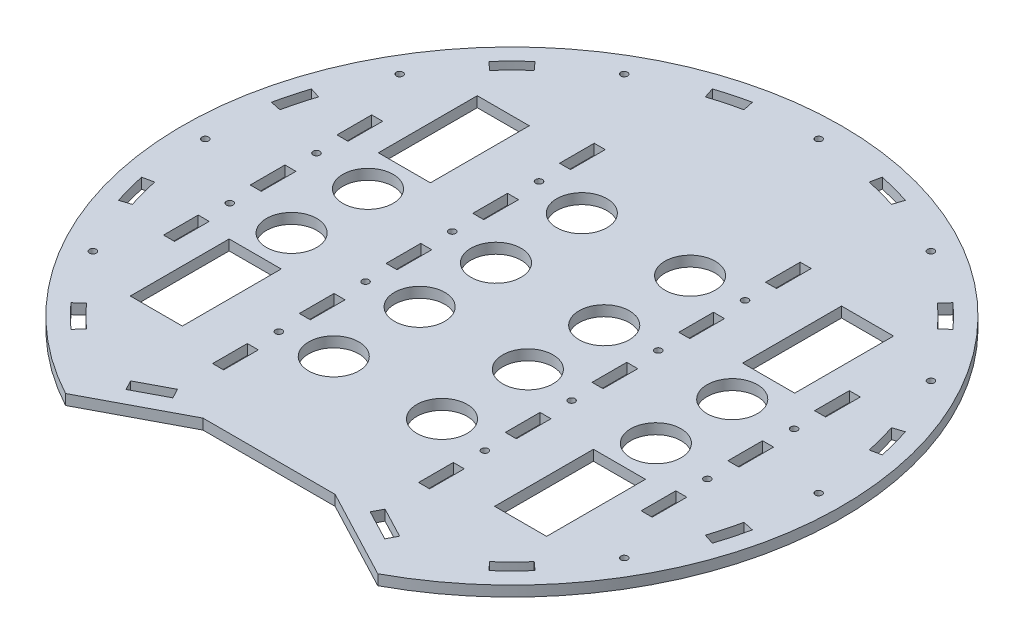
from build123d import *

# Parameters (mm, degrees)
SKETCH1_R           = 14.5
SKETCH1_R_2         = 1.9558
SKETCH1_W           = 30
SKETCH1_H           = 57
SKETCH1_W_2         = 6.35
SKETCH1_H_2         = 20
BOSS_EXTRUDE1_DEPTH = 6


with BuildPart() as part:
    # Sketch1 → Boss-Extrude1 (new body)
    with BuildSketch(Plane(origin=(0, 0, 0), x_dir=(1, 0, 0), z_dir=(0, 1, 0))):
        with BuildLine():
            Line((-90, -167.332005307), (-38.1, -140))
            Line((-38.1, -140), (38.1, -140))
            Line((38.1, -140), (90, -167.332005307))
            ThreePointArc((90, -167.332005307), (0, 190), (-90, -167.332005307))
        make_face()
        with Locations(Location((-105, -22.009925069, 0), (0, 0, 270))):
            Circle(SKETCH1_R, mode=Mode.SUBTRACT)
        with Locations(Location((-105, 22.009925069, 0), (0, 0, 270))):
            Circle(SKETCH1_R, mode=Mode.SUBTRACT)
        with Locations(Location((105, 22.009925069, 0), (0, 0, 270))):
            Circle(SKETCH1_R, mode=Mode.SUBTRACT)
        with Locations(Location((105, -22.009925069, 0), (0, 0, 270))):
            Circle(SKETCH1_R, mode=Mode.SUBTRACT)
        with Locations(Location((-31.203328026, 22.009925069, 0), (0, 0, 270))):
            Circle(SKETCH1_R, mode=Mode.SUBTRACT)
        with Locations(Location((-31.203328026, 71.509925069, 0), (0, 0, 270))):
            Circle(SKETCH1_R, mode=Mode.SUBTRACT)
        with Locations(Location((-31.203328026, -22.009925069, 0), (0, 0, 270))):
            Circle(SKETCH1_R, mode=Mode.SUBTRACT)
        with Locations(Location((-31.203328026, -71.509925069, 0), (0, 0, 270))):
            Circle(SKETCH1_R, mode=Mode.SUBTRACT)
        with Locations(Location((31.203328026, -71.509925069, 0), (0, 0, 270))):
            Circle(SKETCH1_R, mode=Mode.SUBTRACT)
        with Locations(Location((31.203328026, -22.009925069, 0), (0, 0, 270))):
            Circle(SKETCH1_R, mode=Mode.SUBTRACT)
        with Locations(Location((31.203328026, 71.509925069, 0), (0, 0, 270))):
            Circle(SKETCH1_R, mode=Mode.SUBTRACT)
        with Locations(Location((31.203328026, 22.009925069, 0), (0, 0, 270))):
            Circle(SKETCH1_R, mode=Mode.SUBTRACT)
        with Locations(Location((-59.378328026, 75, 0), (0, 0, 270))):
            Circle(SKETCH1_R_2, mode=Mode.SUBTRACT)
        with Locations(Location((-59.378328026, 25, 0), (0, 0, 270))):
            Circle(SKETCH1_R_2, mode=Mode.SUBTRACT)
        with Locations(Location((-137.675, 25, 0), (0, 0, 270))):
            Circle(SKETCH1_R_2, mode=Mode.SUBTRACT)
        with Locations(Location((-137.675, -25, 0), (0, 0, 270))):
            Circle(SKETCH1_R_2, mode=Mode.SUBTRACT)
        with Locations(Location((-59.378328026, -25, 0), (0, 0, 270))):
            Circle(SKETCH1_R_2, mode=Mode.SUBTRACT)
        with Locations(Location((-59.378328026, -75, 0), (0, 0, 270))):
            Circle(SKETCH1_R_2, mode=Mode.SUBTRACT)
        with Locations(Location((0, 176.832186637, 0), (0, 0, 270))):
            Circle(SKETCH1_R_2, mode=Mode.SUBTRACT)
        with Locations(Location((88.416093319, 153.141165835, 0), (0, 0, 270))):
            Circle(SKETCH1_R_2, mode=Mode.SUBTRACT)
        with Locations(Location((153.141165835, 88.416093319, 0), (0, 0, 270))):
            Circle(SKETCH1_R_2, mode=Mode.SUBTRACT)
        with Locations(Location((176.832186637, 0, 0), (0, 0, 270))):
            Circle(SKETCH1_R_2, mode=Mode.SUBTRACT)
        with Locations(Location((153.141165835, -88.416093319, 0), (0, 0, 270))):
            Circle(SKETCH1_R_2, mode=Mode.SUBTRACT)
        with Locations(Location((-88.416093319, 153.141165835, 0), (0, 0, 270))):
            Circle(SKETCH1_R_2, mode=Mode.SUBTRACT)
        with Locations(Location((-153.141165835, 88.416093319, 0), (0, 0, 270))):
            Circle(SKETCH1_R_2, mode=Mode.SUBTRACT)
        with Locations(Location((-176.832186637, 0, 0), (0, 0, 270))):
            Circle(SKETCH1_R_2, mode=Mode.SUBTRACT)
        with Locations(Location((-153.141165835, -88.416093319, 0), (0, 0, 270))):
            Circle(SKETCH1_R_2, mode=Mode.SUBTRACT)
        with Locations(Location((59.378328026, 75, 0), (0, 0, 270))):
            Circle(SKETCH1_R_2, mode=Mode.SUBTRACT)
        with Locations(Location((59.378328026, 25, 0), (0, 0, 270))):
            Circle(SKETCH1_R_2, mode=Mode.SUBTRACT)
        with Locations(Location((59.378328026, -75, 0), (0, 0, 270))):
            Circle(SKETCH1_R_2, mode=Mode.SUBTRACT)
        with Locations(Location((59.378328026, -25, 0), (0, 0, 270))):
            Circle(SKETCH1_R_2, mode=Mode.SUBTRACT)
        with Locations(Location((137.675, -25, 0), (0, 0, 270))):
            Circle(SKETCH1_R_2, mode=Mode.SUBTRACT)
        with Locations(Location((137.675, 25, 0), (0, 0, 270))):
            Circle(SKETCH1_R_2, mode=Mode.SUBTRACT)
        with Locations((-105, -71.509925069)):
            Rectangle(SKETCH1_W, SKETCH1_H, mode=Mode.SUBTRACT)
        with Locations((-105, 71.509925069)):
            Rectangle(SKETCH1_W, SKETCH1_H, mode=Mode.SUBTRACT)
        with Locations((105, 71.509925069)):
            Rectangle(SKETCH1_W, SKETCH1_H, mode=Mode.SUBTRACT)
        with Locations((105, -71.509925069)):
            Rectangle(SKETCH1_W, SKETCH1_H, mode=Mode.SUBTRACT)
        with Locations((137.675, -50)):
            Rectangle(SKETCH1_W_2, SKETCH1_H_2, mode=Mode.SUBTRACT)
        with Locations((-137.675, 50)):
            Rectangle(SKETCH1_W_2, SKETCH1_H_2, mode=Mode.SUBTRACT)
        with Locations((-137.675, 0)):
            Rectangle(SKETCH1_W_2, SKETCH1_H_2, mode=Mode.SUBTRACT)
        with Locations((-137.675, -50)):
            Rectangle(SKETCH1_W_2, SKETCH1_H_2, mode=Mode.SUBTRACT)
        with Locations((137.675, 0)):
            Rectangle(SKETCH1_W_2, SKETCH1_H_2, mode=Mode.SUBTRACT)
        with Locations((137.675, 50)):
            Rectangle(SKETCH1_W_2, SKETCH1_H_2, mode=Mode.SUBTRACT)
        with BuildLine():
            Line((-53.660801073, 165.150964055), (-55.623058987, 171.190172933))
            ThreePointArc((-55.623058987, 171.190172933), (-46.587428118, 173.866648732), (-37.424104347, 176.066568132))
            Line((-37.424104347, 176.066568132), (-36.103865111, 169.855330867))
            ThreePointArc((-36.103865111, 169.855330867), (-44.943927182, 167.733019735), (-53.660801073, 165.150964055))
        make_face(mode=Mode.SUBTRACT)
        with BuildLine():
            Line((-120.443509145, 133.766068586), (-116.194529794, 129.047098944))
            ThreePointArc((-116.194529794, 129.047098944), (-122.789092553, 122.789092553), (-129.047098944, 116.194529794))
            Line((-129.047098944, 116.194529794), (-133.766068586, 120.443509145))
            ThreePointArc((-133.766068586, 120.443509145), (-127.279220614, 127.279220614), (-120.443509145, 133.766068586))
        make_face(mode=Mode.SUBTRACT)
        with BuildLine():
            Line((-171.190172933, 55.623058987), (-165.150964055, 53.660801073))
            ThreePointArc((-165.150964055, 53.660801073), (-167.733019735, 44.943927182), (-169.855330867, 36.103865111))
            Line((-169.855330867, 36.103865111), (-176.066568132, 37.424104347))
            ThreePointArc((-176.066568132, 37.424104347), (-173.866648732, 46.587428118), (-171.190172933, 55.623058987))
        make_face(mode=Mode.SUBTRACT)
        with BuildLine():
            Line((-176.066568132, -37.424104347), (-169.855330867, -36.103865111))
            ThreePointArc((-169.855330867, -36.103865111), (-167.733019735, -44.943927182), (-165.150964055, -53.660801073))
            Line((-165.150964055, -53.660801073), (-171.190172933, -55.623058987))
            ThreePointArc((-171.190172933, -55.623058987), (-173.866648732, -46.587428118), (-176.066568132, -37.424104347))
        make_face(mode=Mode.SUBTRACT)
        with BuildLine():
            Line((-133.766068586, -120.443509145), (-129.047098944, -116.194529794))
            ThreePointArc((-129.047098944, -116.194529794), (-122.789092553, -122.789092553), (-116.194529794, -129.047098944))
            Line((-116.194529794, -129.047098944), (-120.443509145, -133.766068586))
            ThreePointArc((-120.443509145, -133.766068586), (-127.279220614, -127.279220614), (-133.766068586, -120.443509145))
        make_face(mode=Mode.SUBTRACT)
        with Locations((59.378328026, 0)):
            Rectangle(SKETCH1_W_2, SKETCH1_H_2, mode=Mode.SUBTRACT)
        with BuildLine():
            Line((116.194529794, -129.047098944), (120.443509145, -133.766068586))
            ThreePointArc((120.443509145, -133.766068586), (127.279220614, -127.279220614), (133.766068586, -120.443509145))
            Line((133.766068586, -120.443509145), (129.047098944, -116.194529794))
            ThreePointArc((129.047098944, -116.194529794), (122.789092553, -122.789092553), (116.194529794, -129.047098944))
        make_face(mode=Mode.SUBTRACT)
        with BuildLine():
            Line((165.150964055, -53.660801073), (171.190172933, -55.623058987))
            ThreePointArc((171.190172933, -55.623058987), (173.866648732, -46.587428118), (176.066568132, -37.424104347))
            Line((176.066568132, -37.424104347), (169.855330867, -36.103865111))
            ThreePointArc((169.855330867, -36.103865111), (167.733019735, -44.943927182), (165.150964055, -53.660801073))
        make_face(mode=Mode.SUBTRACT)
        with BuildLine():
            Line((169.855330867, 36.103865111), (176.066568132, 37.424104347))
            ThreePointArc((176.066568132, 37.424104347), (173.866648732, 46.587428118), (171.190172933, 55.623058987))
            Line((171.190172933, 55.623058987), (165.150964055, 53.660801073))
            ThreePointArc((165.150964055, 53.660801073), (167.733019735, 44.943927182), (169.855330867, 36.103865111))
        make_face(mode=Mode.SUBTRACT)
        with BuildLine():
            Line((129.047098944, 116.194529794), (133.766068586, 120.443509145))
            ThreePointArc((133.766068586, 120.443509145), (127.279220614, 127.279220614), (120.443509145, 133.766068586))
            Line((120.443509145, 133.766068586), (116.194529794, 129.047098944))
            ThreePointArc((116.194529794, 129.047098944), (122.789092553, 122.789092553), (129.047098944, 116.194529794))
        make_face(mode=Mode.SUBTRACT)
        with BuildLine():
            Line((37.424104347, 176.066568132), (36.103865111, 169.855330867))
            ThreePointArc((36.103865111, 169.855330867), (44.943927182, 167.733019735), (53.660801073, 165.150964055))
            Line((53.660801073, 165.150964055), (55.623058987, 171.190172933))
            ThreePointArc((55.623058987, 171.190172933), (46.587428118, 173.866648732), (37.424104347, 176.066568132))
        make_face(mode=Mode.SUBTRACT)
        Polygon((-56.879281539, -138.587765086), (-59.838145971, -132.969258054), (-77.534231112, -142.288516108), (-74.57536668, -147.90702314), align=None, mode=Mode.SUBTRACT)
        Polygon((77.534231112, -142.288516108), (74.57536668, -147.90702314), (56.879281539, -138.587765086), (59.838145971, -132.969258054), align=None, mode=Mode.SUBTRACT)
        with Locations((-59.378328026, 50)):
            Rectangle(SKETCH1_W_2, SKETCH1_H_2, mode=Mode.SUBTRACT)
        with Locations((-59.378328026, 0)):
            Rectangle(SKETCH1_W_2, SKETCH1_H_2, mode=Mode.SUBTRACT)
        with Locations((-59.378328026, 100)):
            Rectangle(SKETCH1_W_2, SKETCH1_H_2, mode=Mode.SUBTRACT)
        with Locations((-59.378328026, -50)):
            Rectangle(SKETCH1_W_2, SKETCH1_H_2, mode=Mode.SUBTRACT)
        with Locations((-59.378328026, -100)):
            Rectangle(SKETCH1_W_2, SKETCH1_H_2, mode=Mode.SUBTRACT)
        with Locations((59.378328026, -50)):
            Rectangle(SKETCH1_W_2, SKETCH1_H_2, mode=Mode.SUBTRACT)
        with Locations((59.378328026, -100)):
            Rectangle(SKETCH1_W_2, SKETCH1_H_2, mode=Mode.SUBTRACT)
        with Locations((59.378328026, 100)):
            Rectangle(SKETCH1_W_2, SKETCH1_H_2, mode=Mode.SUBTRACT)
        with Locations((59.378328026, 50)):
            Rectangle(SKETCH1_W_2, SKETCH1_H_2, mode=Mode.SUBTRACT)
    extrude(amount=BOSS_EXTRUDE1_DEPTH)


solid = part.part
